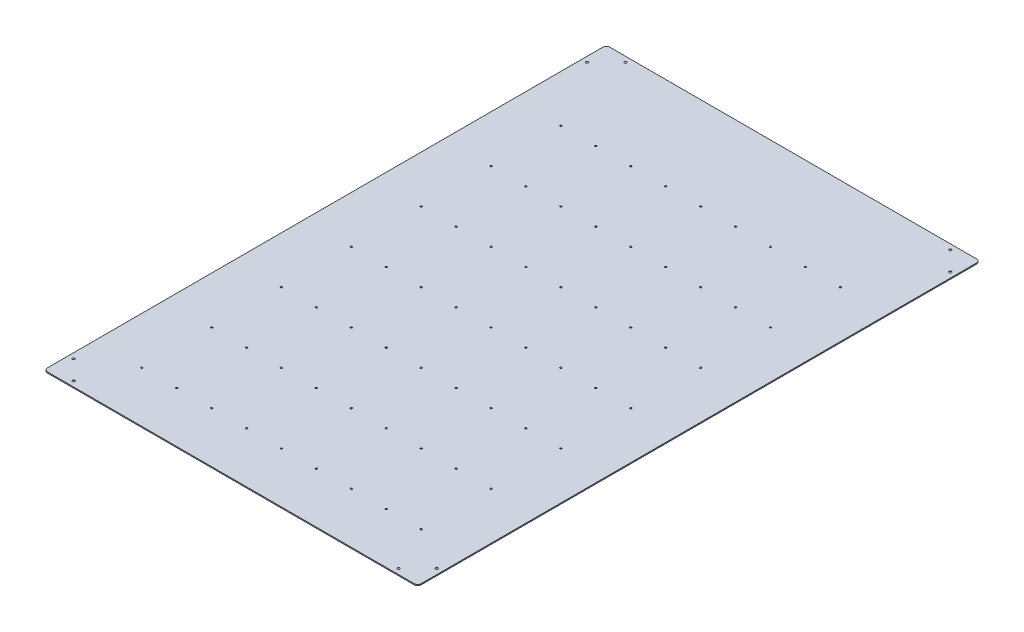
from build123d import *

# Parameters (mm, degrees)
SKETCH_1_W                  = 1070
SKETCH_1_H                  = 1610
EXTRUDE_1_DEPTH             = 3
HOLE_WIZARD_M6_1_AT_2_COUNT = 2
HOLE_WIZARD_M6_1_AT_2_PITCH = 77.781745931
HOLE_WIZARD_M6_1_AT_3_COUNT = 2
HOLE_WIZARD_M6_1_AT_3_PITCH = 1525.991480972
HOLE_WIZARD_M6_1_AT_4_COUNT = 2
HOLE_WIZARD_M6_1_AT_4_PITCH = 1580
HOLE_WIZARD_M6_1_AT_5_COUNT = 2
HOLE_WIZARD_M6_1_AT_5_PITCH = 1833.384847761
HOLE_WIZARD_M6_1_AT_6_COUNT = 2
HOLE_WIZARD_M6_1_AT_6_PITCH = 1815.44760321
HOLE_WIZARD_M6_1_AT_7_COUNT = 2
HOLE_WIZARD_M6_1_AT_7_PITCH = 986.534337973
HOLE_WIZARD_M6_1_AT_8_COUNT = 2
HOLE_WIZARD_M6_1_AT_8_PITCH = 930
HOLE_WIZARD_M6_1_2_D        = 5
PATTERN_LINEAR_1_COUNT      = 7
PATTERN_LINEAR_1_PITCH      = 200
PATTERN_LINEAR_1_COUNT_DIR2 = 9
PATTERN_LINEAR_1_PITCH_DIR2 = 100
FILLET_1_R                  = 10


with BuildPart() as part:
    # Sketch 1 → Extrude 1 (new body)
    with BuildSketch(Plane(origin=(0, 0, 0), x_dir=(1, 0, 0), z_dir=(0, 1, 0))):
        Rectangle(SKETCH_1_W, SKETCH_1_H)
    extrude(amount=EXTRUDE_1_DEPTH)

    # Sketch 5 → Hole Wizard M6 _1 (revolve, cut)
    with BuildSketch(Plane(origin=(465, 0, -790), x_dir=(0, 0, -1), z_dir=(1, 0, 0))):
        Polygon((0, 0), (0, 3), (3.5, 3), (3.5, 2.9), (6.4, 0), align=None)
    hole_wizard_m6_1 = revolve(axis=Axis((465, -6.35, -790), (0, 1, 0)), mode=Mode.SUBTRACT)

    # Hole Wizard M6 _1 at 2: Hole Wizard M6 _1 ×2
    with Locations(*[Vector(0.7071067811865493, 0, 0.7071067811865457) * (i * HOLE_WIZARD_M6_1_AT_2_PITCH) for i in range(1, HOLE_WIZARD_M6_1_AT_2_COUNT)]):
        add(hole_wizard_m6_1, mode=Mode.SUBTRACT)

    # Hole Wizard M6 _1 at 3: Hole Wizard M6 _1 ×2
    with Locations(*[Vector(0.036042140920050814, 0, 0.9993502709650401) * (i * HOLE_WIZARD_M6_1_AT_3_PITCH) for i in range(1, HOLE_WIZARD_M6_1_AT_3_COUNT)]):
        add(hole_wizard_m6_1, mode=Mode.SUBTRACT)

    # Hole Wizard M6 _1 at 4: Hole Wizard M6 _1 ×2
    with Locations(*[(0, 0, i * HOLE_WIZARD_M6_1_AT_4_PITCH) for i in range(1, HOLE_WIZARD_M6_1_AT_4_COUNT)]):
        add(hole_wizard_m6_1, mode=Mode.SUBTRACT)

    # Hole Wizard M6 _1 at 5: Hole Wizard M6 _1 ×2
    with Locations(*[Vector(-0.5072584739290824, 0, 0.8617939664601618) * (i * HOLE_WIZARD_M6_1_AT_5_PITCH) for i in range(1, HOLE_WIZARD_M6_1_AT_5_COUNT)]):
        add(hole_wizard_m6_1, mode=Mode.SUBTRACT)

    # Hole Wizard M6 _1 at 6: Hole Wizard M6 _1 ×2
    with Locations(*[Vector(-0.54256592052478, 0, 0.8400132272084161) * (i * HOLE_WIZARD_M6_1_AT_6_PITCH) for i in range(1, HOLE_WIZARD_M6_1_AT_6_COUNT)]):
        add(hole_wizard_m6_1, mode=Mode.SUBTRACT)

    # Hole Wizard M6 _1 at 7: Hole Wizard M6 _1 ×2
    with Locations(*[Vector(-0.9984447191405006, 0, 0.0557507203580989) * (i * HOLE_WIZARD_M6_1_AT_7_PITCH) for i in range(1, HOLE_WIZARD_M6_1_AT_7_COUNT)]):
        add(hole_wizard_m6_1, mode=Mode.SUBTRACT)

    # Hole Wizard M6 _1 at 8: Hole Wizard M6 _1 ×2
    with Locations(*[(-i * HOLE_WIZARD_M6_1_AT_8_PITCH, 0, 0) for i in range(1, HOLE_WIZARD_M6_1_AT_8_COUNT)]):
        add(hole_wizard_m6_1, mode=Mode.SUBTRACT)

    # Hole Wizard M6 _1 2 (through all)
    with Locations(Plane(origin=(0, 3, 0), x_dir=(1, 0, 0), z_dir=(0, 1, 0))):
        with Locations((-400, -660)):
            hole_wizard_m6_1_2 = Hole(HOLE_WIZARD_M6_1_2_D / 2)

    # Pattern Linear 1: Hole Wizard M6 _1 2 7 × 9
    with Locations(*[(j * PATTERN_LINEAR_1_PITCH_DIR2, 0, -i * PATTERN_LINEAR_1_PITCH) for i in range(PATTERN_LINEAR_1_COUNT) for j in range(PATTERN_LINEAR_1_COUNT_DIR2) if (i, j) != (0, 0)]):
        add(hole_wizard_m6_1_2, mode=Mode.SUBTRACT)

    # Fillet 1
    fillet_1_edges = [part.edges().sort_by_distance(p)[0] for p in [
        (535, 1.5, 805),
        (-535, 1.5, 805),
        (-535, 1.5, -805),
        (535, 1.5, -805),
    ]]
    fillet(fillet_1_edges, radius=FILLET_1_R)


solid = part.part
